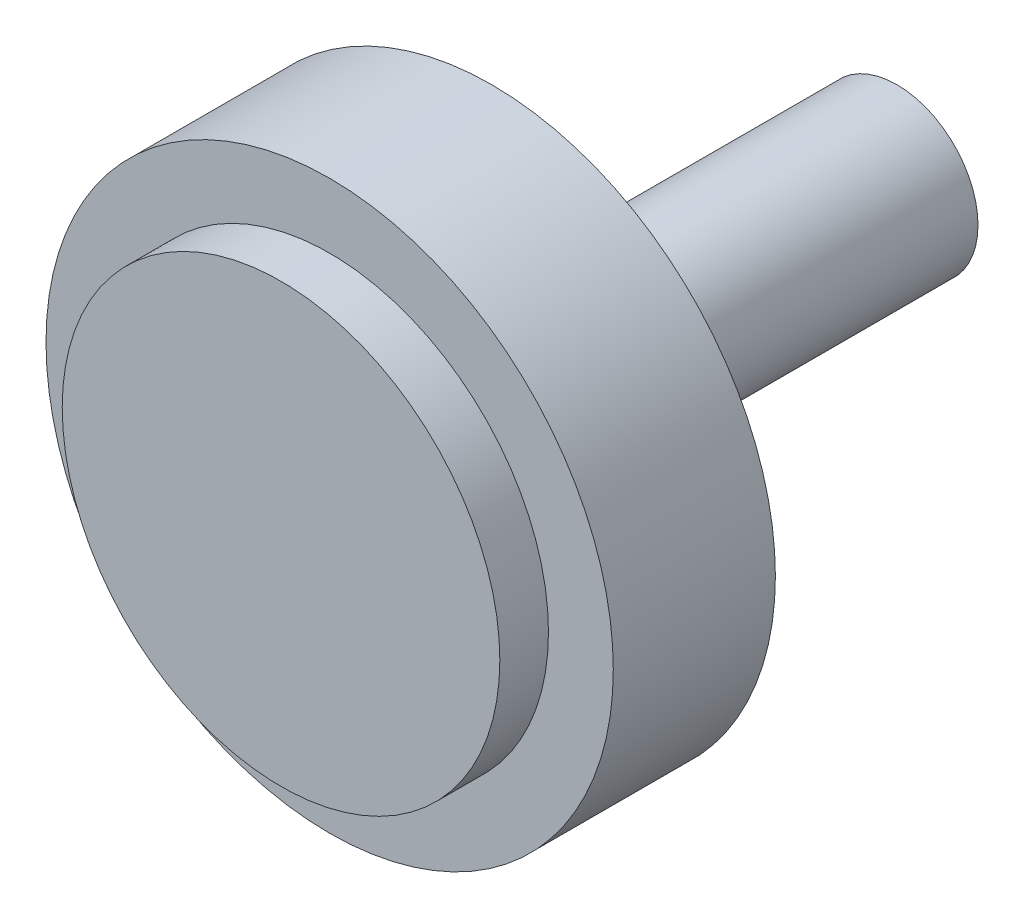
ISO-10303-21;
HEADER;
FILE_DESCRIPTION(('STEP AP214'),'2;1');
FILE_NAME('part.step','',(''),(''),'','','');
FILE_SCHEMA(('AUTOMOTIVE_DESIGN { 1 0 10303 214 1 1 1 1 }'));
ENDSEC;
DATA;
#1=APPLICATION_CONTEXT('core data for automotive mechanical design processes');
#2=APPLICATION_PROTOCOL_DEFINITION('international standard','automotive_design',2000,#1);
#3=PRODUCT_CONTEXT('',#1,'mechanical');
#4=PRODUCT('Part','Part','',(#3));
#5=PRODUCT_RELATED_PRODUCT_CATEGORY('part','',(#4));
#6=PRODUCT_DEFINITION_FORMATION('','',#4);
#7=PRODUCT_DEFINITION_CONTEXT('part definition',#1,'design');
#8=PRODUCT_DEFINITION('design','',#6,#7);
#9=PRODUCT_DEFINITION_SHAPE('','',#8);
#10=(LENGTH_UNIT() NAMED_UNIT(*) SI_UNIT(.MILLI.,.METRE.));
#11=(NAMED_UNIT(*) PLANE_ANGLE_UNIT() SI_UNIT($,.RADIAN.));
#12=(NAMED_UNIT(*) SI_UNIT($,.STERADIAN.) SOLID_ANGLE_UNIT());
#13=UNCERTAINTY_MEASURE_WITH_UNIT(LENGTH_MEASURE(1.E-05),#10,'distance_accuracy_value','');
#14=(GEOMETRIC_REPRESENTATION_CONTEXT(3) GLOBAL_UNCERTAINTY_ASSIGNED_CONTEXT((#13)) GLOBAL_UNIT_ASSIGNED_CONTEXT((#10,
#11,#12)) REPRESENTATION_CONTEXT('',''));
#15=CARTESIAN_POINT('',(0.,0.,0.));
#16=DIRECTION('',(0.,0.,1.));
#17=DIRECTION('',(1.,0.,0.));
#18=AXIS2_PLACEMENT_3D('',#15,#16,#17);
#19=CARTESIAN_POINT('',(0.,0.,0.));
#20=DIRECTION('',(0.,0.,1.));
#21=DIRECTION('',(1.,0.,0.));
#22=AXIS2_PLACEMENT_3D('',#19,#20,#21);
#23=PLANE('',#22);
#24=CARTESIAN_POINT('',(0.,0.,0.));
#25=DIRECTION('',(0.,0.,1.));
#26=DIRECTION('',(1.,0.,0.));
#27=AXIS2_PLACEMENT_3D('',#24,#25,#26);
#28=CIRCLE('',#27,17.5);
#29=CARTESIAN_POINT('',(17.5,0.,0.));
#30=VERTEX_POINT('',#29);
#31=EDGE_CURVE('E40',#30,#30,#28,.T.);
#32=ORIENTED_EDGE('',*,*,#31,.F.);
#33=EDGE_LOOP('',(#32));
#34=FACE_BOUND('',#33,.T.);
#35=CARTESIAN_POINT('',(0.,0.,0.));
#36=DIRECTION('',(0.,0.,1.));
#37=DIRECTION('',(1.,0.,0.));
#38=AXIS2_PLACEMENT_3D('',#35,#36,#37);
#39=CIRCLE('',#38,5.);
#40=CARTESIAN_POINT('',(5.,0.,0.));
#41=VERTEX_POINT('',#40);
#42=EDGE_CURVE('E10',#41,#41,#39,.F.);
#43=ORIENTED_EDGE('',*,*,#42,.F.);
#44=EDGE_LOOP('',(#43));
#45=FACE_BOUND('',#44,.T.);
#46=ADVANCED_FACE('F29',(#34,#45),#23,.F.);
#47=CARTESIAN_POINT('',(0.,0.,10.));
#48=DIRECTION('',(0.,0.,1.));
#49=DIRECTION('',(1.,0.,0.));
#50=AXIS2_PLACEMENT_3D('',#47,#48,#49);
#51=PLANE('',#50);
#52=CARTESIAN_POINT('',(0.,0.,10.));
#53=DIRECTION('',(0.,0.,1.));
#54=DIRECTION('',(1.,0.,0.));
#55=AXIS2_PLACEMENT_3D('',#52,#53,#54);
#56=CIRCLE('',#55,17.5);
#57=CARTESIAN_POINT('',(17.5,0.,10.));
#58=VERTEX_POINT('',#57);
#59=EDGE_CURVE('E36',#58,#58,#56,.T.);
#60=ORIENTED_EDGE('',*,*,#59,.T.);
#61=EDGE_LOOP('',(#60));
#62=FACE_BOUND('',#61,.T.);
#63=CARTESIAN_POINT('',(0.,0.,10.));
#64=DIRECTION('',(0.,0.,1.));
#65=DIRECTION('',(1.,0.,0.));
#66=AXIS2_PLACEMENT_3D('',#63,#64,#65);
#67=CIRCLE('',#66,13.5);
#68=CARTESIAN_POINT('',(13.5,0.,10.));
#69=VERTEX_POINT('',#68);
#70=EDGE_CURVE('E47',#69,#69,#67,.T.);
#71=ORIENTED_EDGE('',*,*,#70,.F.);
#72=EDGE_LOOP('',(#71));
#73=FACE_BOUND('',#72,.T.);
#74=ADVANCED_FACE('F71',(#62,#73),#51,.T.);
#75=CARTESIAN_POINT('',(0.,0.,10.));
#76=DIRECTION('',(0.,0.,-1.));
#77=DIRECTION('',(-1.,0.,0.));
#78=AXIS2_PLACEMENT_3D('',#75,#76,#77);
#79=CYLINDRICAL_SURFACE('',#78,17.5);
#80=ORIENTED_EDGE('',*,*,#59,.F.);
#81=EDGE_LOOP('',(#80));
#82=FACE_BOUND('',#81,.T.);
#83=ORIENTED_EDGE('',*,*,#31,.T.);
#84=EDGE_LOOP('',(#83));
#85=FACE_BOUND('',#84,.T.);
#86=ADVANCED_FACE('F31',(#82,#85),#79,.T.);
#87=CARTESIAN_POINT('',(0.,0.,13.));
#88=DIRECTION('',(0.,0.,-1.));
#89=DIRECTION('',(-1.,0.,0.));
#90=AXIS2_PLACEMENT_3D('',#87,#88,#89);
#91=CYLINDRICAL_SURFACE('',#90,13.5);
#92=CARTESIAN_POINT('',(0.,0.,13.));
#93=DIRECTION('',(0.,0.,1.));
#94=DIRECTION('',(1.,0.,0.));
#95=AXIS2_PLACEMENT_3D('',#92,#93,#94);
#96=CIRCLE('',#95,13.5);
#97=CARTESIAN_POINT('',(13.5,0.,13.));
#98=VERTEX_POINT('',#97);
#99=EDGE_CURVE('E45',#98,#98,#96,.T.);
#100=ORIENTED_EDGE('',*,*,#99,.F.);
#101=EDGE_LOOP('',(#100));
#102=FACE_BOUND('',#101,.T.);
#103=ORIENTED_EDGE('',*,*,#70,.T.);
#104=EDGE_LOOP('',(#103));
#105=FACE_BOUND('',#104,.T.);
#106=ADVANCED_FACE('F67',(#102,#105),#91,.T.);
#107=CARTESIAN_POINT('',(0.,0.,13.));
#108=DIRECTION('',(0.,0.,1.));
#109=DIRECTION('',(1.,0.,0.));
#110=AXIS2_PLACEMENT_3D('',#107,#108,#109);
#111=PLANE('',#110);
#112=ORIENTED_EDGE('',*,*,#99,.T.);
#113=EDGE_LOOP('',(#112));
#114=FACE_BOUND('',#113,.T.);
#115=ADVANCED_FACE('F60',(#114),#111,.T.);
#116=CARTESIAN_POINT('',(0.,0.,-25.));
#117=DIRECTION('',(0.,0.,1.));
#118=DIRECTION('',(1.,0.,0.));
#119=AXIS2_PLACEMENT_3D('',#116,#117,#118);
#120=CYLINDRICAL_SURFACE('',#119,5.);
#121=CARTESIAN_POINT('',(0.,0.,-25.));
#122=DIRECTION('',(0.,0.,-1.));
#123=DIRECTION('',(-1.,0.,0.));
#124=AXIS2_PLACEMENT_3D('',#121,#122,#123);
#125=CIRCLE('',#124,5.);
#126=CARTESIAN_POINT('',(-5.,0.,-25.));
#127=VERTEX_POINT('',#126);
#128=EDGE_CURVE('E50',#127,#127,#125,.T.);
#129=ORIENTED_EDGE('',*,*,#128,.F.);
#130=EDGE_LOOP('',(#129));
#131=FACE_BOUND('',#130,.T.);
#132=ORIENTED_EDGE('',*,*,#42,.T.);
#133=EDGE_LOOP('',(#132));
#134=FACE_BOUND('',#133,.T.);
#135=ADVANCED_FACE('F58',(#131,#134),#120,.T.);
#136=CARTESIAN_POINT('',(0.,0.,-25.));
#137=DIRECTION('',(0.,0.,-1.));
#138=DIRECTION('',(-1.,0.,0.));
#139=AXIS2_PLACEMENT_3D('',#136,#137,#138);
#140=PLANE('',#139);
#141=ORIENTED_EDGE('',*,*,#128,.T.);
#142=EDGE_LOOP('',(#141));
#143=FACE_BOUND('',#142,.T.);
#144=ADVANCED_FACE('F56',(#143),#140,.T.);
#145=CLOSED_SHELL('',(#46,#74,#86,#106,#115,#135,#144));
#146=MANIFOLD_SOLID_BREP('B2',#145);
#147=ADVANCED_BREP_SHAPE_REPRESENTATION('',(#18,#146),#14);
#148=SHAPE_DEFINITION_REPRESENTATION(#9,#147);
ENDSEC;
END-ISO-10303-21;
